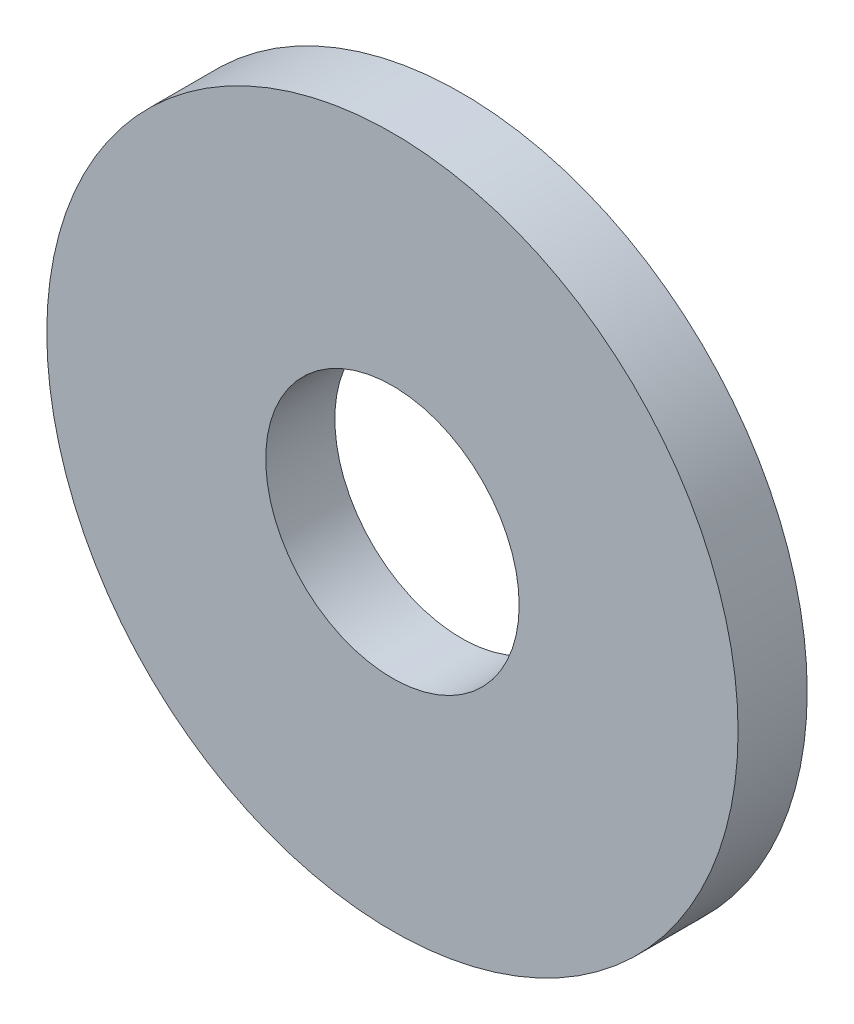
from build123d import *

# Parameters (mm, degrees)
ESQUISSE1_R          = 3
ESQUISSE1_R_2        = 1.1
BASE_EXTRUSION_DEPTH = 0.6


with BuildPart() as part:
    # Esquisse1 → Base-Extrusion (new body)
    with BuildSketch(Plane.XY):
        Circle(ESQUISSE1_R)
        Circle(ESQUISSE1_R_2, mode=Mode.SUBTRACT)
    extrude(amount=BASE_EXTRUSION_DEPTH)


solid = part.part
